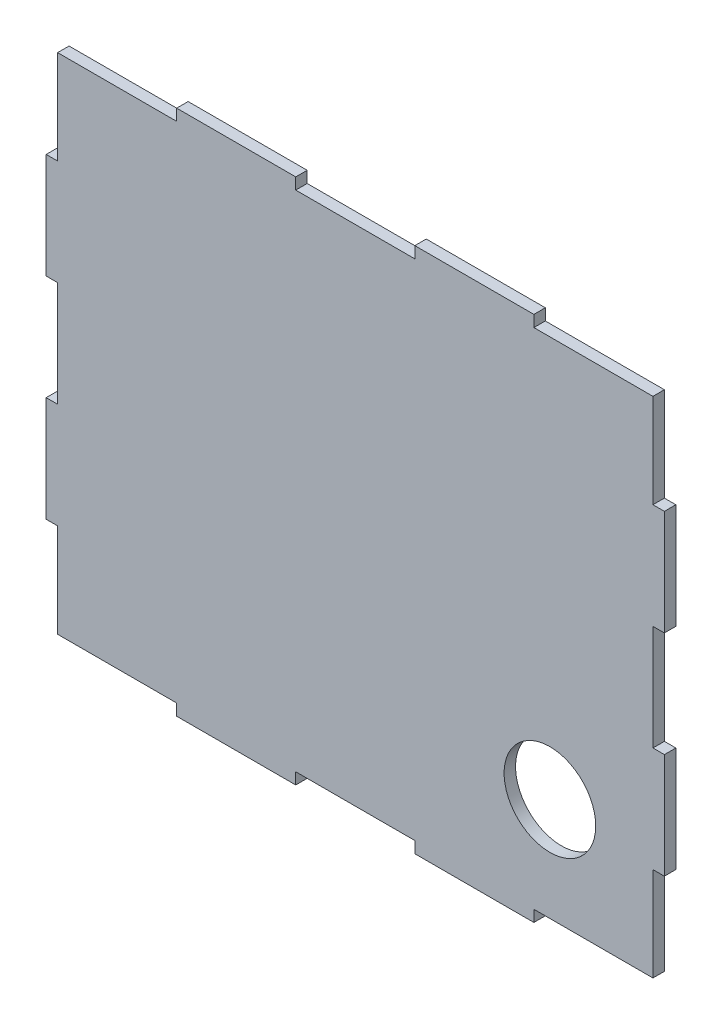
from build123d import *

# Parameters (mm, degrees)
SKETCH1_R           = 12.7
BOSS_EXTRUDE1_DEPTH = 3.175


with BuildPart() as part:
    # Sketch1 → Boss-Extrude1 (new body)
    with BuildSketch(Plane(origin=(0, 0, 0), x_dir=(-1, 0, 0), z_dir=(0, 0, -1))):
        Polygon((-36.195, 143.234833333), (-36.195, 146.409833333), (-69.215, 146.409833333), (-69.215, 143.234833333), (-102.235, 143.234833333), (-102.235, 146.409833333), (-135.255, 146.409833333), (-135.255, 143.234833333), (-168.275, 143.234833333), (-168.275, 117.199833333), (-171.45, 117.199833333), (-171.45, 87.989833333), (-168.275, 87.989833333), (-168.275, 58.779833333), (-171.45, 58.779833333), (-171.45, 29.569833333), (-168.275, 29.569833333), (-168.275, 3.534833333), (-135.255, 3.534833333), (-135.255, 0.359833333), (-102.235, 0.359833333), (-102.235, 3.534833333), (-69.215, 3.534833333), (-69.215, 0.359833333), (-36.195, 0.359833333), (-36.195, 3.534833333), (-3.175, 3.534833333), (-3.175, 29.569833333), (0, 29.569833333), (0, 58.779833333), (-3.175, 58.779833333), (-3.175, 87.989833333), (0, 87.989833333), (0, 117.199833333), (-3.175, 117.199833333), (-3.175, 143.234833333), align=None)
        with Locations(Location((-139.7, 32.109833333, 0), (0, 0, 180))):
            Circle(SKETCH1_R, mode=Mode.SUBTRACT)
    extrude(amount=-BOSS_EXTRUDE1_DEPTH)


solid = part.part
